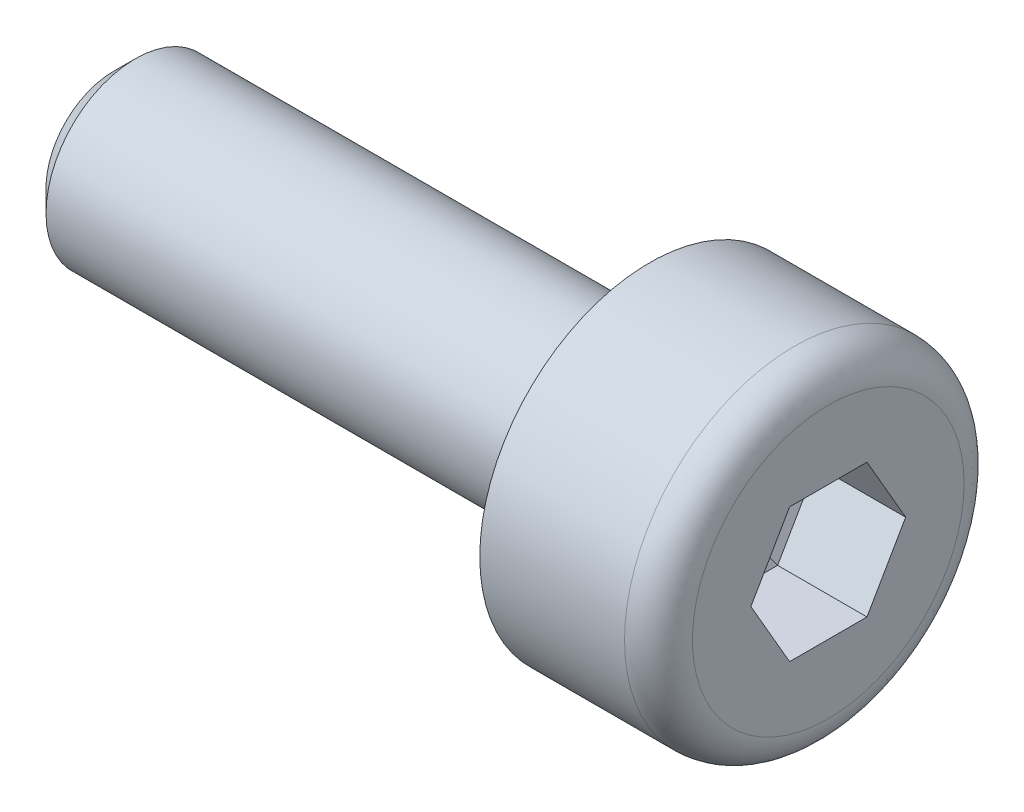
ISO-10303-21;
HEADER;
FILE_DESCRIPTION(('STEP AP214'),'2;1');
FILE_NAME('part.step','',(''),(''),'','','');
FILE_SCHEMA(('AUTOMOTIVE_DESIGN { 1 0 10303 214 1 1 1 1 }'));
ENDSEC;
DATA;
#1=APPLICATION_CONTEXT('core data for automotive mechanical design processes');
#2=APPLICATION_PROTOCOL_DEFINITION('international standard','automotive_design',2000,#1);
#3=PRODUCT_CONTEXT('',#1,'mechanical');
#4=PRODUCT('Part','Part','',(#3));
#5=PRODUCT_RELATED_PRODUCT_CATEGORY('part','',(#4));
#6=PRODUCT_DEFINITION_FORMATION('','',#4);
#7=PRODUCT_DEFINITION_CONTEXT('part definition',#1,'design');
#8=PRODUCT_DEFINITION('design','',#6,#7);
#9=PRODUCT_DEFINITION_SHAPE('','',#8);
#10=(LENGTH_UNIT() NAMED_UNIT(*) SI_UNIT(.MILLI.,.METRE.));
#11=(NAMED_UNIT(*) PLANE_ANGLE_UNIT() SI_UNIT($,.RADIAN.));
#12=(NAMED_UNIT(*) SI_UNIT($,.STERADIAN.) SOLID_ANGLE_UNIT());
#13=UNCERTAINTY_MEASURE_WITH_UNIT(LENGTH_MEASURE(1.E-05),#10,'distance_accuracy_value','');
#14=(GEOMETRIC_REPRESENTATION_CONTEXT(3) GLOBAL_UNCERTAINTY_ASSIGNED_CONTEXT((#13)) GLOBAL_UNIT_ASSIGNED_CONTEXT((#10,
#11,#12)) REPRESENTATION_CONTEXT('',''));
#15=CARTESIAN_POINT('',(0.,0.,0.));
#16=DIRECTION('',(0.,0.,1.));
#17=DIRECTION('',(1.,0.,0.));
#18=AXIS2_PLACEMENT_3D('',#15,#16,#17);
#19=CARTESIAN_POINT('',(-1.4272391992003,-0.015490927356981,0.0017841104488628));
#20=DIRECTION('',(-1.,0.,0.));
#21=DIRECTION('',(0.,0.809016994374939,0.587785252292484));
#22=AXIS2_PLACEMENT_3D('',#19,#20,#21);
#23=PLANE('',#22);
#24=DIRECTION('',(0.,-0.866025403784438,0.500000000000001));
#25=VECTOR('',#24,1.);
#26=CARTESIAN_POINT('',(-1.4272391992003,0.00500000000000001,0.00866025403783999));
#27=LINE('',#26,#25);
#28=CARTESIAN_POINT('',(-1.4272391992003,0.00999999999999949,0.00577350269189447));
#29=VERTEX_POINT('',#28);
#30=CARTESIAN_POINT('',(-1.4272391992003,0.,0.011547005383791));
#31=VERTEX_POINT('',#30);
#32=EDGE_CURVE('E136',#29,#31,#27,.T.);
#33=ORIENTED_EDGE('',*,*,#32,.T.);
#34=DIRECTION('',(0.,-0.866025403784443,-0.499999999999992));
#35=VECTOR('',#34,1.);
#36=CARTESIAN_POINT('',(-1.4272391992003,-0.00500000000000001,0.00866025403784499));
#37=LINE('',#36,#35);
#38=CARTESIAN_POINT('',(-1.4272391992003,-0.0100000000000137,0.00577350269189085));
#39=VERTEX_POINT('',#38);
#40=EDGE_CURVE('E128',#31,#39,#37,.T.);
#41=ORIENTED_EDGE('',*,*,#40,.T.);
#42=DIRECTION('',(0.,0.,-1.));
#43=VECTOR('',#42,1.);
#44=CARTESIAN_POINT('',(-1.4272391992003,-0.010000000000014,0.));
#45=LINE('',#44,#43);
#46=CARTESIAN_POINT('',(-1.4272391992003,-0.0100000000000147,-0.00577350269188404));
#47=VERTEX_POINT('',#46);
#48=EDGE_CURVE('E110',#39,#47,#45,.T.);
#49=ORIENTED_EDGE('',*,*,#48,.T.);
#50=DIRECTION('',(0.,0.866025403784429,-0.500000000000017));
#51=VECTOR('',#50,1.);
#52=CARTESIAN_POINT('',(-1.4272391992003,-0.00500000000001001,-0.00866025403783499));
#53=LINE('',#52,#51);
#54=CARTESIAN_POINT('',(-1.4272391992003,0.,-0.0115470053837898));
#55=VERTEX_POINT('',#54);
#56=EDGE_CURVE('E91',#47,#55,#53,.T.);
#57=ORIENTED_EDGE('',*,*,#56,.T.);
#58=DIRECTION('',(0.,0.866025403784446,0.499999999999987));
#59=VECTOR('',#58,1.);
#60=CARTESIAN_POINT('',(-1.4272391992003,0.004999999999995,-0.00866025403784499));
#61=LINE('',#60,#59);
#62=CARTESIAN_POINT('',(-1.4272391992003,0.00999999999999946,-0.00577350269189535));
#63=VERTEX_POINT('',#62);
#64=EDGE_CURVE('E86',#55,#63,#61,.T.);
#65=ORIENTED_EDGE('',*,*,#64,.T.);
#66=DIRECTION('',(0.,0.,1.));
#67=VECTOR('',#66,1.);
#68=CARTESIAN_POINT('',(-1.4272391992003,0.00999999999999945,0.));
#69=LINE('',#68,#67);
#70=EDGE_CURVE('E88',#63,#29,#69,.T.);
#71=ORIENTED_EDGE('',*,*,#70,.T.);
#72=EDGE_LOOP('',(#33,#41,#49,#57,#65,#71));
#73=FACE_BOUND('',#72,.T.);
#74=ADVANCED_FACE('F17',(#73),#23,.F.);
#75=CARTESIAN_POINT('',(-1.4272391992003,0.0099999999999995,-0.43301270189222));
#76=DIRECTION('',(-0.866025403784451,0.499999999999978,0.));
#77=DIRECTION('',(0.,0.,1.));
#78=AXIS2_PLACEMENT_3D('',#75,#76,#77);
#79=PLANE('',#78);
#80=ORIENTED_EDGE('',*,*,#70,.F.);
#81=DIRECTION('',(0.447213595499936,0.774596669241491,-0.447213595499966));
#82=VECTOR('',#81,1.);
#83=CARTESIAN_POINT('',(-1.4272391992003,0.00999999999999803,-0.00577350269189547));
#84=LINE('',#83,#82);
#85=CARTESIAN_POINT('',(-1.,0.750000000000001,-0.433012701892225));
#86=VERTEX_POINT('',#85);
#87=EDGE_CURVE('E21',#63,#86,#84,.T.);
#88=ORIENTED_EDGE('',*,*,#87,.T.);
#89=DIRECTION('',(0.,0.,1.));
#90=VECTOR('',#89,1.);
#91=CARTESIAN_POINT('',(-1.,0.75,0.0669872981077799));
#92=LINE('',#91,#90);
#93=CARTESIAN_POINT('',(-1.,0.75,0.433012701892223));
#94=VERTEX_POINT('',#93);
#95=EDGE_CURVE('E224',#86,#94,#92,.T.);
#96=ORIENTED_EDGE('',*,*,#95,.T.);
#97=DIRECTION('',(-0.447213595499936,-0.774596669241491,-0.447213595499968));
#98=VECTOR('',#97,1.);
#99=CARTESIAN_POINT('',(-0.999999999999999,0.750000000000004,0.433012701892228));
#100=LINE('',#99,#98);
#101=EDGE_CURVE('E101',#94,#29,#100,.T.);
#102=ORIENTED_EDGE('',*,*,#101,.T.);
#103=EDGE_LOOP('',(#80,#88,#96,#102));
#104=FACE_BOUND('',#103,.T.);
#105=ADVANCED_FACE('F98',(#104),#79,.F.);
#106=CARTESIAN_POINT('',(-1.4272391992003,-0.37000000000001,-0.22516660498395));
#107=DIRECTION('',(-0.866025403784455,0.24999999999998,-0.433012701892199));
#108=DIRECTION('',(0.,0.866025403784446,0.499999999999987));
#109=AXIS2_PLACEMENT_3D('',#106,#107,#108);
#110=PLANE('',#109);
#111=DIRECTION('',(0.,0.866025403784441,0.499999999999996));
#112=VECTOR('',#111,1.);
#113=CARTESIAN_POINT('',(-1.,0.433012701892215,-0.616025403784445));
#114=LINE('',#113,#112);
#115=CARTESIAN_POINT('',(-1.,0.,-0.866025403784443));
#116=VERTEX_POINT('',#115);
#117=EDGE_CURVE('E106',#116,#86,#114,.T.);
#118=ORIENTED_EDGE('',*,*,#117,.T.);
#119=ORIENTED_EDGE('',*,*,#87,.F.);
#120=ORIENTED_EDGE('',*,*,#64,.F.);
#121=DIRECTION('',(0.447213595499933,0.,-0.894427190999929));
#122=VECTOR('',#121,1.);
#123=CARTESIAN_POINT('',(-1.4272391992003,0.,-0.0115470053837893));
#124=LINE('',#123,#122);
#125=EDGE_CURVE('E108',#55,#116,#124,.T.);
#126=ORIENTED_EDGE('',*,*,#125,.T.);
#127=EDGE_LOOP('',(#118,#119,#120,#126));
#128=FACE_BOUND('',#127,.T.);
#129=ADVANCED_FACE('F104',(#128),#110,.F.);
#130=CARTESIAN_POINT('',(-1.4272391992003,-0.38000000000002,0.20784609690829));
#131=DIRECTION('',(-0.866025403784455,-0.249999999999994,-0.433012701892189));
#132=DIRECTION('',(0.,0.866025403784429,-0.500000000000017));
#133=AXIS2_PLACEMENT_3D('',#130,#131,#132);
#134=PLANE('',#133);
#135=DIRECTION('',(0.,0.866025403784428,-0.500000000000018));
#136=VECTOR('',#135,1.);
#137=CARTESIAN_POINT('',(-1.,-0.316987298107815,-0.6830127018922));
#138=LINE('',#137,#136);
#139=CARTESIAN_POINT('',(-1.,-0.750000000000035,-0.433012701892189));
#140=VERTEX_POINT('',#139);
#141=EDGE_CURVE('E115',#140,#116,#138,.T.);
#142=ORIENTED_EDGE('',*,*,#141,.T.);
#143=ORIENTED_EDGE('',*,*,#125,.F.);
#144=ORIENTED_EDGE('',*,*,#56,.F.);
#145=DIRECTION('',(0.447213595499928,-0.77459666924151,-0.447213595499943));
#146=VECTOR('',#145,1.);
#147=CARTESIAN_POINT('',(-1.4272391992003,-0.0100000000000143,-0.00577350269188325));
#148=LINE('',#147,#146);
#149=EDGE_CURVE('E122',#47,#140,#148,.T.);
#150=ORIENTED_EDGE('',*,*,#149,.T.);
#151=EDGE_LOOP('',(#142,#143,#144,#150));
#152=FACE_BOUND('',#151,.T.);
#153=ADVANCED_FACE('F229',(#152),#134,.F.);
#154=CARTESIAN_POINT('',(-1.4272391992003,-0.0099999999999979,0.4330127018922));
#155=DIRECTION('',(-0.866025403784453,-0.499999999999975,0.));
#156=DIRECTION('',(0.,0.,-1.));
#157=AXIS2_PLACEMENT_3D('',#154,#155,#156);
#158=PLANE('',#157);
#159=DIRECTION('',(0.,0.,-1.));
#160=VECTOR('',#159,1.);
#161=CARTESIAN_POINT('',(-1.,-0.75000000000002,-0.0669872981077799));
#162=LINE('',#161,#160);
#163=CARTESIAN_POINT('',(-1.,-0.750000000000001,0.433012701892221));
#164=VERTEX_POINT('',#163);
#165=EDGE_CURVE('E120',#164,#140,#162,.T.);
#166=ORIENTED_EDGE('',*,*,#165,.T.);
#167=ORIENTED_EDGE('',*,*,#149,.F.);
#168=ORIENTED_EDGE('',*,*,#48,.F.);
#169=DIRECTION('',(0.447213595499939,-0.774596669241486,0.447213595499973));
#170=VECTOR('',#169,1.);
#171=CARTESIAN_POINT('',(-1.4272391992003,-0.010000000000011,0.00577350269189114));
#172=LINE('',#171,#170);
#173=EDGE_CURVE('E130',#39,#164,#172,.T.);
#174=ORIENTED_EDGE('',*,*,#173,.T.);
#175=EDGE_LOOP('',(#166,#167,#168,#174));
#176=FACE_BOUND('',#175,.T.);
#177=ADVANCED_FACE('F234',(#176),#158,.F.);
#178=CARTESIAN_POINT('',(-1.4272391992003,0.37,0.22516660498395));
#179=DIRECTION('',(-0.866025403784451,-0.249999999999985,0.433012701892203));
#180=DIRECTION('',(0.,-0.866025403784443,-0.499999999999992));
#181=AXIS2_PLACEMENT_3D('',#178,#179,#180);
#182=PLANE('',#181);
#183=DIRECTION('',(0.,-0.866025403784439,-0.499999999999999));
#184=VECTOR('',#183,1.);
#185=CARTESIAN_POINT('',(-1.,-0.43301270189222,0.61602540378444));
#186=LINE('',#185,#184);
#187=CARTESIAN_POINT('',(-1.,0.,0.866025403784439));
#188=VERTEX_POINT('',#187);
#189=EDGE_CURVE('E127',#188,#164,#186,.T.);
#190=ORIENTED_EDGE('',*,*,#189,.T.);
#191=ORIENTED_EDGE('',*,*,#173,.F.);
#192=ORIENTED_EDGE('',*,*,#40,.F.);
#193=DIRECTION('',(0.447213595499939,0.,0.894427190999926));
#194=VECTOR('',#193,1.);
#195=CARTESIAN_POINT('',(-1.4272391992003,0.,0.0115470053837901));
#196=LINE('',#195,#194);
#197=EDGE_CURVE('E138',#31,#188,#196,.T.);
#198=ORIENTED_EDGE('',*,*,#197,.T.);
#199=EDGE_LOOP('',(#190,#191,#192,#198));
#200=FACE_BOUND('',#199,.T.);
#201=ADVANCED_FACE('F286',(#200),#182,.F.);
#202=CARTESIAN_POINT('',(-1.4272391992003,0.38,-0.20784609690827));
#203=DIRECTION('',(-0.866025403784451,0.249999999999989,0.4330127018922));
#204=DIRECTION('',(0.,-0.866025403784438,0.500000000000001));
#205=AXIS2_PLACEMENT_3D('',#202,#203,#204);
#206=PLANE('',#205);
#207=DIRECTION('',(0.,-0.866025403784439,0.499999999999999));
#208=VECTOR('',#207,1.);
#209=CARTESIAN_POINT('',(-1.,0.31698729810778,0.68301270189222));
#210=LINE('',#209,#208);
#211=EDGE_CURVE('E139',#94,#188,#210,.T.);
#212=ORIENTED_EDGE('',*,*,#211,.T.);
#213=ORIENTED_EDGE('',*,*,#197,.F.);
#214=ORIENTED_EDGE('',*,*,#32,.F.);
#215=ORIENTED_EDGE('',*,*,#101,.F.);
#216=EDGE_LOOP('',(#212,#213,#214,#215));
#217=FACE_BOUND('',#216,.T.);
#218=ADVANCED_FACE('F289',(#217),#206,.F.);
#219=CARTESIAN_POINT('',(0.,0.75,-0.43301270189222));
#220=DIRECTION('',(0.,1.,0.));
#221=DIRECTION('',(-1.,0.,0.));
#222=AXIS2_PLACEMENT_3D('',#219,#220,#221);
#223=PLANE('',#222);
#224=DIRECTION('',(-1.,0.,0.));
#225=VECTOR('',#224,1.);
#226=CARTESIAN_POINT('',(-0.5,0.75,0.43301270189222));
#227=LINE('',#226,#225);
#228=CARTESIAN_POINT('',(0.,0.75,0.433012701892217));
#229=VERTEX_POINT('',#228);
#230=EDGE_CURVE('E135',#229,#94,#227,.T.);
#231=ORIENTED_EDGE('',*,*,#230,.T.);
#232=ORIENTED_EDGE('',*,*,#95,.F.);
#233=DIRECTION('',(1.,0.,0.));
#234=VECTOR('',#233,1.);
#235=CARTESIAN_POINT('',(-0.5,0.750000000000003,-0.433012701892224));
#236=LINE('',#235,#234);
#237=CARTESIAN_POINT('',(0.,0.750000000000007,-0.433012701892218));
#238=VERTEX_POINT('',#237);
#239=EDGE_CURVE('E113',#86,#238,#236,.T.);
#240=ORIENTED_EDGE('',*,*,#239,.T.);
#241=DIRECTION('',(0.,0.,-1.));
#242=VECTOR('',#241,1.);
#243=CARTESIAN_POINT('',(0.,0.749999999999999,0.433012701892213));
#244=LINE('',#243,#242);
#245=EDGE_CURVE('E143',#229,#238,#244,.T.);
#246=ORIENTED_EDGE('',*,*,#245,.F.);
#247=EDGE_LOOP('',(#231,#232,#240,#246));
#248=FACE_BOUND('',#247,.T.);
#249=ADVANCED_FACE('F293',(#248),#223,.F.);
#250=CARTESIAN_POINT('',(0.,0.,-0.86602540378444));
#251=DIRECTION('',(0.,0.499999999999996,-0.866025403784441));
#252=DIRECTION('',(-1.,0.,0.));
#253=AXIS2_PLACEMENT_3D('',#250,#251,#252);
#254=PLANE('',#253);
#255=ORIENTED_EDGE('',*,*,#239,.F.);
#256=ORIENTED_EDGE('',*,*,#117,.F.);
#257=DIRECTION('',(1.,0.,0.));
#258=VECTOR('',#257,1.);
#259=CARTESIAN_POINT('',(-0.5,0.,-0.866025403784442));
#260=LINE('',#259,#258);
#261=CARTESIAN_POINT('',(0.,0.,-0.866025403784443));
#262=VERTEX_POINT('',#261);
#263=EDGE_CURVE('E118',#116,#262,#260,.T.);
#264=ORIENTED_EDGE('',*,*,#263,.T.);
#265=DIRECTION('',(0.,-0.86602540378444,-0.499999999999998));
#266=VECTOR('',#265,1.);
#267=CARTESIAN_POINT('',(0.,0.750000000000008,-0.433012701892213));
#268=LINE('',#267,#266);
#269=EDGE_CURVE('E218',#238,#262,#268,.T.);
#270=ORIENTED_EDGE('',*,*,#269,.F.);
#271=EDGE_LOOP('',(#255,#256,#264,#270));
#272=FACE_BOUND('',#271,.T.);
#273=ADVANCED_FACE('F248',(#272),#254,.F.);
#274=CARTESIAN_POINT('',(0.,-0.75000000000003,-0.43301270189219));
#275=DIRECTION('',(0.,-0.500000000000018,-0.866025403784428));
#276=DIRECTION('',(-1.,0.,0.));
#277=AXIS2_PLACEMENT_3D('',#274,#275,#276);
#278=PLANE('',#277);
#279=ORIENTED_EDGE('',*,*,#263,.F.);
#280=ORIENTED_EDGE('',*,*,#141,.F.);
#281=DIRECTION('',(1.,0.,0.));
#282=VECTOR('',#281,1.);
#283=CARTESIAN_POINT('',(-0.5,-0.750000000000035,-0.43301270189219));
#284=LINE('',#283,#282);
#285=CARTESIAN_POINT('',(0.,-0.750000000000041,-0.433012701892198));
#286=VERTEX_POINT('',#285);
#287=EDGE_CURVE('E125',#140,#286,#284,.T.);
#288=ORIENTED_EDGE('',*,*,#287,.T.);
#289=DIRECTION('',(0.,-0.866025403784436,0.500000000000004));
#290=VECTOR('',#289,1.);
#291=CARTESIAN_POINT('',(0.,0.,-0.866025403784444));
#292=LINE('',#291,#290);
#293=EDGE_CURVE('E215',#262,#286,#292,.T.);
#294=ORIENTED_EDGE('',*,*,#293,.F.);
#295=EDGE_LOOP('',(#279,#280,#288,#294));
#296=FACE_BOUND('',#295,.T.);
#297=ADVANCED_FACE('F241',(#296),#278,.F.);
#298=CARTESIAN_POINT('',(0.,-0.75,0.43301270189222));
#299=DIRECTION('',(0.,-1.,0.));
#300=DIRECTION('',(-1.,0.,0.));
#301=AXIS2_PLACEMENT_3D('',#298,#299,#300);
#302=PLANE('',#301);
#303=ORIENTED_EDGE('',*,*,#287,.F.);
#304=ORIENTED_EDGE('',*,*,#165,.F.);
#305=DIRECTION('',(1.,0.,0.));
#306=VECTOR('',#305,1.);
#307=CARTESIAN_POINT('',(-0.5,-0.750000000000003,0.43301270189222));
#308=LINE('',#307,#306);
#309=CARTESIAN_POINT('',(0.,-0.750000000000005,0.433012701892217));
#310=VERTEX_POINT('',#309);
#311=EDGE_CURVE('E133',#164,#310,#308,.T.);
#312=ORIENTED_EDGE('',*,*,#311,.T.);
#313=DIRECTION('',(0.,0.,1.));
#314=VECTOR('',#313,1.);
#315=CARTESIAN_POINT('',(0.,-0.750000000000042,-0.433012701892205));
#316=LINE('',#315,#314);
#317=EDGE_CURVE('E212',#286,#310,#316,.T.);
#318=ORIENTED_EDGE('',*,*,#317,.F.);
#319=EDGE_LOOP('',(#303,#304,#312,#318));
#320=FACE_BOUND('',#319,.T.);
#321=ADVANCED_FACE('F244',(#320),#302,.F.);
#322=CARTESIAN_POINT('',(0.,0.,0.86602540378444));
#323=DIRECTION('',(0.,-0.499999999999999,0.866025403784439));
#324=DIRECTION('',(-1.,0.,0.));
#325=AXIS2_PLACEMENT_3D('',#322,#323,#324);
#326=PLANE('',#325);
#327=ORIENTED_EDGE('',*,*,#311,.F.);
#328=ORIENTED_EDGE('',*,*,#189,.F.);
#329=DIRECTION('',(1.,0.,0.));
#330=VECTOR('',#329,1.);
#331=CARTESIAN_POINT('',(-0.5,0.,0.86602540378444));
#332=LINE('',#331,#330);
#333=CARTESIAN_POINT('',(0.,0.,0.866025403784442));
#334=VERTEX_POINT('',#333);
#335=EDGE_CURVE('E36',#188,#334,#332,.T.);
#336=ORIENTED_EDGE('',*,*,#335,.T.);
#337=DIRECTION('',(0.,0.86602540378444,0.499999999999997));
#338=VECTOR('',#337,1.);
#339=CARTESIAN_POINT('',(0.,-0.750000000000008,0.433012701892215));
#340=LINE('',#339,#338);
#341=EDGE_CURVE('E209',#310,#334,#340,.T.);
#342=ORIENTED_EDGE('',*,*,#341,.F.);
#343=EDGE_LOOP('',(#327,#328,#336,#342));
#344=FACE_BOUND('',#343,.T.);
#345=ADVANCED_FACE('F303',(#344),#326,.F.);
#346=CARTESIAN_POINT('',(0.,0.75,0.43301270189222));
#347=DIRECTION('',(0.,0.499999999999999,0.866025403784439));
#348=DIRECTION('',(-1.,0.,0.));
#349=AXIS2_PLACEMENT_3D('',#346,#347,#348);
#350=PLANE('',#349);
#351=ORIENTED_EDGE('',*,*,#335,.F.);
#352=ORIENTED_EDGE('',*,*,#211,.F.);
#353=ORIENTED_EDGE('',*,*,#230,.F.);
#354=DIRECTION('',(0.,0.866025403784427,-0.50000000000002));
#355=VECTOR('',#354,1.);
#356=CARTESIAN_POINT('',(0.,0.,0.866025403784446));
#357=LINE('',#356,#355);
#358=EDGE_CURVE('E206',#334,#229,#357,.T.);
#359=ORIENTED_EDGE('',*,*,#358,.F.);
#360=EDGE_LOOP('',(#351,#352,#353,#359));
#361=FACE_BOUND('',#360,.T.);
#362=ADVANCED_FACE('F165',(#361),#350,.F.);
#363=CARTESIAN_POINT('',(0.,-0.33627224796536,-2.1231394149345));
#364=DIRECTION('',(1.,0.,0.));
#365=DIRECTION('',(0.,0.809016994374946,0.587785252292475));
#366=AXIS2_PLACEMENT_3D('',#363,#364,#365);
#367=PLANE('',#366);
#368=ORIENTED_EDGE('',*,*,#341,.T.);
#369=ORIENTED_EDGE('',*,*,#358,.T.);
#370=ORIENTED_EDGE('',*,*,#245,.T.);
#371=ORIENTED_EDGE('',*,*,#269,.T.);
#372=ORIENTED_EDGE('',*,*,#293,.T.);
#373=ORIENTED_EDGE('',*,*,#317,.T.);
#374=EDGE_LOOP('',(#368,#369,#370,#371,#372,#373));
#375=FACE_BOUND('',#374,.T.);
#376=CARTESIAN_POINT('',(0.,0.,0.));
#377=DIRECTION('',(-1.,0.,0.));
#378=DIRECTION('',(0.,0.809016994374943,0.58778525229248));
#379=AXIS2_PLACEMENT_3D('',#376,#377,#378);
#380=CIRCLE('',#379,1.51999999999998);
#381=CARTESIAN_POINT('',(0.,1.2297058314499,0.89343358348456));
#382=VERTEX_POINT('',#381);
#383=EDGE_CURVE('E150',#382,#382,#380,.T.);
#384=ORIENTED_EDGE('',*,*,#383,.F.);
#385=EDGE_LOOP('',(#384));
#386=FACE_BOUND('',#385,.T.);
#387=ADVANCED_FACE('F155',(#375,#386),#367,.T.);
#388=CARTESIAN_POINT('',(-8.,-1.59835316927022,0.122598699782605));
#389=DIRECTION('',(-1.,0.,0.));
#390=DIRECTION('',(0.,0.809016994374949,0.587785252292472));
#391=AXIS2_PLACEMENT_3D('',#388,#389,#390);
#392=PLANE('',#391);
#393=CARTESIAN_POINT('',(-8.,0.,0.));
#394=DIRECTION('',(1.,0.,0.));
#395=DIRECTION('',(0.,0.,-1.));
#396=AXIS2_PLACEMENT_3D('',#393,#394,#395);
#397=CIRCLE('',#396,0.754639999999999);
#398=CARTESIAN_POINT('',(-8.,0.,-0.754639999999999));
#399=VERTEX_POINT('',#398);
#400=EDGE_CURVE('E202',#399,#399,#397,.F.);
#401=ORIENTED_EDGE('',*,*,#400,.T.);
#402=EDGE_LOOP('',(#401));
#403=FACE_BOUND('',#402,.T.);
#404=ADVANCED_FACE('F164',(#403),#392,.T.);
#405=CARTESIAN_POINT('',(-0.38,1.5371322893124,1.1167919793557));
#406=CARTESIAN_POINT('',(0.,1.5371322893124,1.1167919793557));
#407=CARTESIAN_POINT('',(0.,1.2297058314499,0.89343358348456));
#408=CARTESIAN_POINT('',(0.,0.92227937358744,0.67007518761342));
#409=CARTESIAN_POINT('',(-0.38,0.92227937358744,0.67007518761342));
#410=(BOUNDED_CURVE() B_SPLINE_CURVE(2,(#405,#406,#407,#408,#409),.UNSPECIFIED.,.F.,
.F.) B_SPLINE_CURVE_WITH_KNOTS((3,2,3),(0.,0.25,0.5),
.UNSPECIFIED.) CURVE() GEOMETRIC_REPRESENTATION_ITEM() RATIONAL_B_SPLINE_CURVE((1.,
0.70710678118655,1.,0.70710678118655,1.)) REPRESENTATION_ITEM(''));
#411=CARTESIAN_POINT('',(0.,0.,0.));
#412=DIRECTION('',(-1.,0.,0.));
#413=AXIS1_PLACEMENT('',#411,#412);
#414=SURFACE_OF_REVOLUTION('',#410,#413);
#415=ORIENTED_EDGE('',*,*,#383,.T.);
#416=EDGE_LOOP('',(#415));
#417=FACE_BOUND('',#416,.T.);
#418=CARTESIAN_POINT('',(-0.38,0.,0.));
#419=DIRECTION('',(-1.,0.,0.));
#420=DIRECTION('',(0.,0.,1.));
#421=AXIS2_PLACEMENT_3D('',#418,#419,#420);
#422=CIRCLE('',#421,1.9);
#423=CARTESIAN_POINT('',(-0.38,0.,1.9));
#424=VERTEX_POINT('',#423);
#425=EDGE_CURVE('E195',#424,#424,#422,.F.);
#426=ORIENTED_EDGE('',*,*,#425,.T.);
#427=EDGE_LOOP('',(#426));
#428=FACE_BOUND('',#427,.T.);
#429=ADVANCED_FACE('F169',(#417,#428),#414,.F.);
#430=CARTESIAN_POINT('',(-7.75464,0.,0.));
#431=DIRECTION('',(1.,0.,0.));
#432=DIRECTION('',(0.,0.,-1.));
#433=AXIS2_PLACEMENT_3D('',#430,#431,#432);
#434=CONICAL_SURFACE('',#433,1.,0.785398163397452);
#435=CARTESIAN_POINT('',(-7.75464,0.,0.));
#436=DIRECTION('',(-1.,0.,0.));
#437=DIRECTION('',(0.,0.80901699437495,0.58778525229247));
#438=AXIS2_PLACEMENT_3D('',#435,#436,#437);
#439=CIRCLE('',#438,1.);
#440=CARTESIAN_POINT('',(-7.75464,0.80901699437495,0.58778525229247));
#441=VERTEX_POINT('',#440);
#442=EDGE_CURVE('E193',#441,#441,#439,.T.);
#443=ORIENTED_EDGE('',*,*,#442,.T.);
#444=EDGE_LOOP('',(#443));
#445=FACE_BOUND('',#444,.T.);
#446=ORIENTED_EDGE('',*,*,#400,.F.);
#447=EDGE_LOOP('',(#446));
#448=FACE_BOUND('',#447,.T.);
#449=ADVANCED_FACE('F175',(#445,#448),#434,.T.);
#450=CARTESIAN_POINT('',(-0.38,0.,0.));
#451=DIRECTION('',(-1.,0.,0.));
#452=DIRECTION('',(0.,0.,1.));
#453=AXIS2_PLACEMENT_3D('',#450,#451,#452);
#454=CYLINDRICAL_SURFACE('',#453,1.9);
#455=ORIENTED_EDGE('',*,*,#425,.F.);
#456=EDGE_LOOP('',(#455));
#457=FACE_BOUND('',#456,.T.);
#458=CARTESIAN_POINT('',(-2.,0.,0.));
#459=DIRECTION('',(-1.,0.,0.));
#460=DIRECTION('',(0.,0.,1.));
#461=AXIS2_PLACEMENT_3D('',#458,#459,#460);
#462=CIRCLE('',#461,1.9);
#463=CARTESIAN_POINT('',(-2.,0.,1.9));
#464=VERTEX_POINT('',#463);
#465=EDGE_CURVE('E27',#464,#464,#462,.T.);
#466=ORIENTED_EDGE('',*,*,#465,.F.);
#467=EDGE_LOOP('',(#466));
#468=FACE_BOUND('',#467,.T.);
#469=ADVANCED_FACE('F185',(#457,#468),#454,.T.);
#470=CARTESIAN_POINT('',(-2.,0.,0.));
#471=DIRECTION('',(-1.,0.,0.));
#472=DIRECTION('',(0.,0.,1.));
#473=AXIS2_PLACEMENT_3D('',#470,#471,#472);
#474=CYLINDRICAL_SURFACE('',#473,1.);
#475=CARTESIAN_POINT('',(-2.,0.,0.));
#476=DIRECTION('',(-1.,0.,0.));
#477=DIRECTION('',(0.,0.,1.));
#478=AXIS2_PLACEMENT_3D('',#475,#476,#477);
#479=CIRCLE('',#478,1.);
#480=CARTESIAN_POINT('',(-2.,0.,1.));
#481=VERTEX_POINT('',#480);
#482=EDGE_CURVE('E11',#481,#481,#479,.F.);
#483=ORIENTED_EDGE('',*,*,#482,.F.);
#484=EDGE_LOOP('',(#483));
#485=FACE_BOUND('',#484,.T.);
#486=ORIENTED_EDGE('',*,*,#442,.F.);
#487=EDGE_LOOP('',(#486));
#488=FACE_BOUND('',#487,.T.);
#489=ADVANCED_FACE('F180',(#485,#488),#474,.T.);
#490=CARTESIAN_POINT('',(-2.,-2.6539242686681,0.4203403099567));
#491=DIRECTION('',(-1.,0.,0.));
#492=DIRECTION('',(0.,0.809016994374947,0.587785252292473));
#493=AXIS2_PLACEMENT_3D('',#490,#491,#492);
#494=PLANE('',#493);
#495=ORIENTED_EDGE('',*,*,#482,.T.);
#496=EDGE_LOOP('',(#495));
#497=FACE_BOUND('',#496,.T.);
#498=ORIENTED_EDGE('',*,*,#465,.T.);
#499=EDGE_LOOP('',(#498));
#500=FACE_BOUND('',#499,.T.);
#501=ADVANCED_FACE('F19',(#497,#500),#494,.T.);
#502=CLOSED_SHELL('',(#74,#105,#129,#153,#177,#201,#218,#249,#273,#297,#321,#345,#362,#387,#404,
#429,#449,#469,#489,#501));
#503=MANIFOLD_SOLID_BREP('B1',#502);
#504=ADVANCED_BREP_SHAPE_REPRESENTATION('',(#18,#503),#14);
#505=SHAPE_DEFINITION_REPRESENTATION(#9,#504);
ENDSEC;
END-ISO-10303-21;
